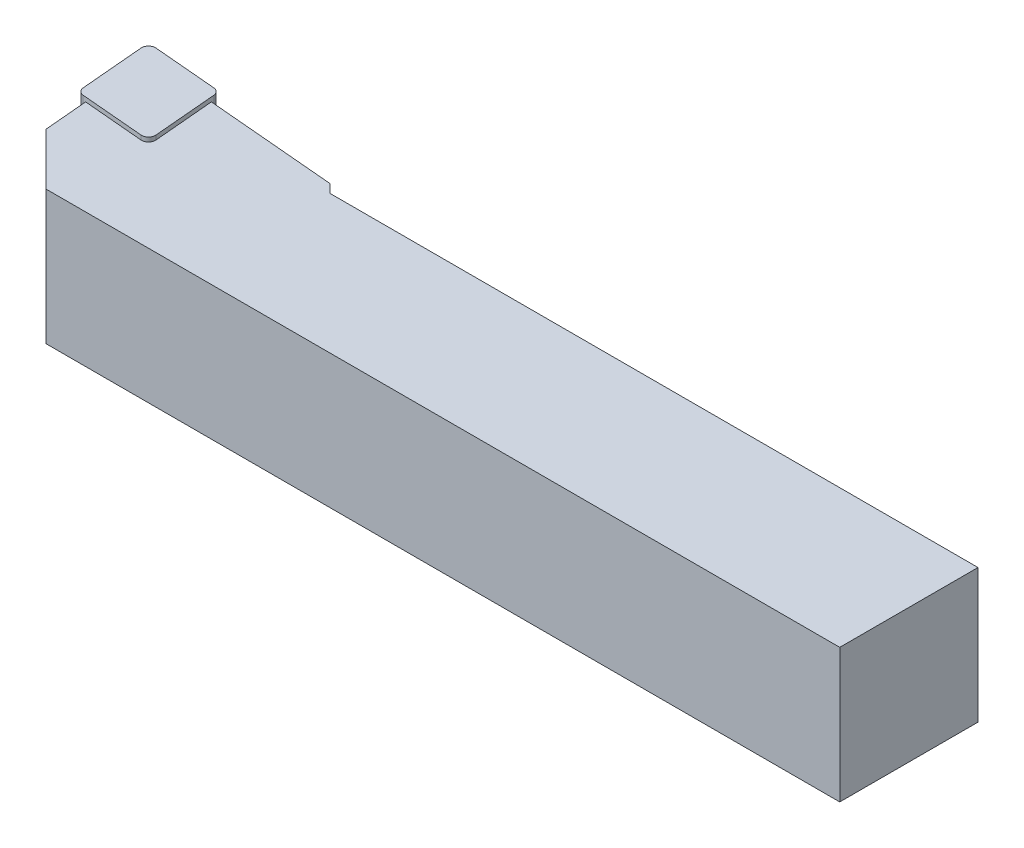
from build123d import *

# Parameters (mm, degrees)
PLAQUETTE_DEPTH  = 4.76
CORPSOUTIL_DEPTH = 15.5


with BuildPart() as part:
    # EsqPlaquette → Plaquette (new body)
    with BuildSketch(Plane(origin=(0, 0, 0), x_dir=(1, 0, 0), z_dir=(0, 1, 0))):
        with BuildLine():
            Line((0.645845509, -8.216976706), (0.003044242, -0.869724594))
            ThreePointArc((0.003044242, -0.869724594), (0.234314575, -0.234314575), (0.869724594, -0.003044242))
            Line((0.869724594, -0.003044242), (8.216976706, -0.645845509))
            ThreePointArc((8.216976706, -0.645845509), (8.712937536, -0.877115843), (8.94420787, -1.373076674))
            Line((8.94420787, -1.373076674), (9.587009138, -8.720328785))
            ThreePointArc((9.587009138, -8.720328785), (9.355738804, -9.355738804), (8.720328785, -9.587009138))
            Line((8.720328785, -9.587009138), (1.373076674, -8.94420787))
            ThreePointArc((1.373076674, -8.94420787), (0.877115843, -8.712937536), (0.645845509, -8.216976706))
        make_face()
    extrude(amount=-PLAQUETTE_DEPTH)

    # EsqCorps → CorpsOutil (add)
    with BuildSketch(Plane(origin=(0, -0.5, 0), x_dir=(-1, 0, 0), z_dir=(0, 1, 0))):
        Polygon((-100, 4), (-100, 20), (-8.137352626, 20), (-2.137352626, 14), (-1, 1), (-24.013412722, 3.013412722), (-25, 4), align=None)
    extrude(amount=-CORPSOUTIL_DEPTH)


solid = part.part
